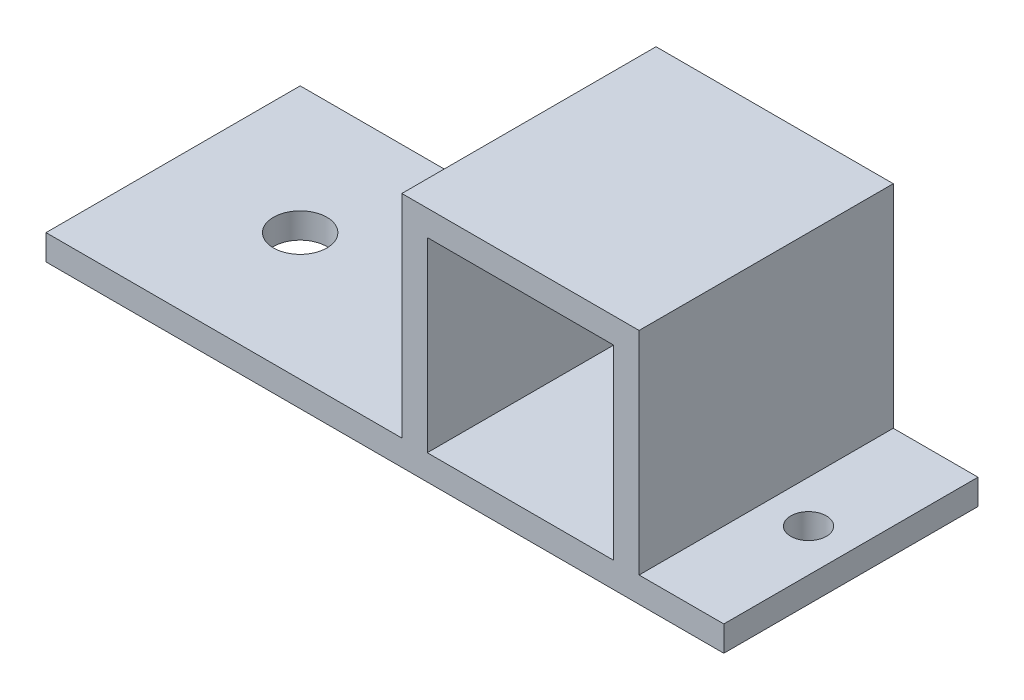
ISO-10303-21;
HEADER;
FILE_DESCRIPTION(('STEP AP214'),'2;1');
FILE_NAME('part.step','',(''),(''),'','','');
FILE_SCHEMA(('AUTOMOTIVE_DESIGN { 1 0 10303 214 1 1 1 1 }'));
ENDSEC;
DATA;
#1=APPLICATION_CONTEXT('core data for automotive mechanical design processes');
#2=APPLICATION_PROTOCOL_DEFINITION('international standard','automotive_design',2000,#1);
#3=PRODUCT_CONTEXT('',#1,'mechanical');
#4=PRODUCT('Part','Part','',(#3));
#5=PRODUCT_RELATED_PRODUCT_CATEGORY('part','',(#4));
#6=PRODUCT_DEFINITION_FORMATION('','',#4);
#7=PRODUCT_DEFINITION_CONTEXT('part definition',#1,'design');
#8=PRODUCT_DEFINITION('design','',#6,#7);
#9=PRODUCT_DEFINITION_SHAPE('','',#8);
#10=(LENGTH_UNIT() NAMED_UNIT(*) SI_UNIT(.MILLI.,.METRE.));
#11=(NAMED_UNIT(*) PLANE_ANGLE_UNIT() SI_UNIT($,.RADIAN.));
#12=(NAMED_UNIT(*) SI_UNIT($,.STERADIAN.) SOLID_ANGLE_UNIT());
#13=UNCERTAINTY_MEASURE_WITH_UNIT(LENGTH_MEASURE(1.E-05),#10,'distance_accuracy_value','');
#14=(GEOMETRIC_REPRESENTATION_CONTEXT(3) GLOBAL_UNCERTAINTY_ASSIGNED_CONTEXT((#13)) GLOBAL_UNIT_ASSIGNED_CONTEXT((#10,
#11,#12)) REPRESENTATION_CONTEXT('',''));
#15=CARTESIAN_POINT('',(0.,0.,0.));
#16=DIRECTION('',(0.,0.,1.));
#17=DIRECTION('',(1.,0.,0.));
#18=AXIS2_PLACEMENT_3D('',#15,#16,#17);
#19=CARTESIAN_POINT('',(-40.,1.5,15.));
#20=DIRECTION('',(0.,-1.,0.));
#21=DIRECTION('',(0.,0.,-1.));
#22=AXIS2_PLACEMENT_3D('',#19,#20,#21);
#23=PLANE('',#22);
#24=CARTESIAN_POINT('',(35.,1.5,0.));
#25=DIRECTION('',(0.,1.,0.));
#26=DIRECTION('',(0.,0.,1.));
#27=AXIS2_PLACEMENT_3D('',#24,#25,#26);
#28=CIRCLE('',#27,2.1);
#29=CARTESIAN_POINT('',(35.,1.5,2.1));
#30=VERTEX_POINT('',#29);
#31=EDGE_CURVE('E157',#30,#30,#28,.T.);
#32=ORIENTED_EDGE('',*,*,#31,.F.);
#33=EDGE_LOOP('',(#32));
#34=FACE_BOUND('',#33,.T.);
#35=DIRECTION('',(0.,0.,-1.));
#36=VECTOR('',#35,1.);
#37=CARTESIAN_POINT('',(30.,1.5,-15.));
#38=LINE('',#37,#36);
#39=CARTESIAN_POINT('',(30.,1.5,15.));
#40=VERTEX_POINT('',#39);
#41=CARTESIAN_POINT('',(30.,1.5,-15.));
#42=VERTEX_POINT('',#41);
#43=EDGE_CURVE('E176',#40,#42,#38,.T.);
#44=ORIENTED_EDGE('',*,*,#43,.F.);
#45=DIRECTION('',(-1.,0.,0.));
#46=VECTOR('',#45,1.);
#47=CARTESIAN_POINT('',(-40.,1.5,15.));
#48=LINE('',#47,#46);
#49=CARTESIAN_POINT('',(40.,1.5,15.));
#50=VERTEX_POINT('',#49);
#51=EDGE_CURVE('E225',#50,#40,#48,.T.);
#52=ORIENTED_EDGE('',*,*,#51,.F.);
#53=DIRECTION('',(0.,0.,-1.));
#54=VECTOR('',#53,1.);
#55=CARTESIAN_POINT('',(40.,1.5,15.));
#56=LINE('',#55,#54);
#57=CARTESIAN_POINT('',(40.,1.5,-15.));
#58=VERTEX_POINT('',#57);
#59=EDGE_CURVE('E11',#50,#58,#56,.T.);
#60=ORIENTED_EDGE('',*,*,#59,.T.);
#61=DIRECTION('',(-1.,0.,0.));
#62=VECTOR('',#61,1.);
#63=CARTESIAN_POINT('',(-40.,1.5,-15.));
#64=LINE('',#63,#62);
#65=EDGE_CURVE('E240',#58,#42,#64,.T.);
#66=ORIENTED_EDGE('',*,*,#65,.T.);
#67=EDGE_LOOP('',(#44,#52,#60,#66));
#68=FACE_BOUND('',#67,.T.);
#69=ADVANCED_FACE('F39',(#34,#68),#23,.F.);
#70=CARTESIAN_POINT('',(-25.,1.5,0.));
#71=DIRECTION('',(0.,1.,0.));
#72=DIRECTION('',(0.,0.,1.));
#73=AXIS2_PLACEMENT_3D('',#70,#71,#72);
#74=CIRCLE('',#73,3.15);
#75=CARTESIAN_POINT('',(-25.,1.5,3.15));
#76=VERTEX_POINT('',#75);
#77=EDGE_CURVE('E342',#76,#76,#74,.T.);
#78=ORIENTED_EDGE('',*,*,#77,.F.);
#79=EDGE_LOOP('',(#78));
#80=FACE_BOUND('',#79,.T.);
#81=DIRECTION('',(0.,0.,1.));
#82=VECTOR('',#81,1.);
#83=CARTESIAN_POINT('',(1.99999999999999,1.5,-15.));
#84=LINE('',#83,#82);
#85=CARTESIAN_POINT('',(1.99999999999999,1.5,-15.));
#86=VERTEX_POINT('',#85);
#87=CARTESIAN_POINT('',(1.99999999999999,1.5,15.));
#88=VERTEX_POINT('',#87);
#89=EDGE_CURVE('E187',#86,#88,#84,.T.);
#90=ORIENTED_EDGE('',*,*,#89,.F.);
#91=CARTESIAN_POINT('',(-40.,1.5,-15.));
#92=VERTEX_POINT('',#91);
#93=EDGE_CURVE('E239',#86,#92,#64,.T.);
#94=ORIENTED_EDGE('',*,*,#93,.T.);
#95=DIRECTION('',(0.,0.,-1.));
#96=VECTOR('',#95,1.);
#97=CARTESIAN_POINT('',(-40.,1.5,15.));
#98=LINE('',#97,#96);
#99=CARTESIAN_POINT('',(-40.,1.5,15.));
#100=VERTEX_POINT('',#99);
#101=EDGE_CURVE('E48',#100,#92,#98,.T.);
#102=ORIENTED_EDGE('',*,*,#101,.F.);
#103=EDGE_CURVE('E223',#88,#100,#48,.T.);
#104=ORIENTED_EDGE('',*,*,#103,.F.);
#105=EDGE_LOOP('',(#90,#94,#102,#104));
#106=FACE_BOUND('',#105,.T.);
#107=ADVANCED_FACE('F281',(#80,#106),#23,.F.);
#108=CARTESIAN_POINT('',(40.,1.5,15.));
#109=DIRECTION('',(-1.,0.,0.));
#110=DIRECTION('',(0.,0.,1.));
#111=AXIS2_PLACEMENT_3D('',#108,#109,#110);
#112=PLANE('',#111);
#113=DIRECTION('',(0.,1.,0.));
#114=VECTOR('',#113,1.);
#115=CARTESIAN_POINT('',(40.,1.5,-15.));
#116=LINE('',#115,#114);
#117=CARTESIAN_POINT('',(40.,-1.5,-15.));
#118=VERTEX_POINT('',#117);
#119=EDGE_CURVE('E218',#118,#58,#116,.T.);
#120=ORIENTED_EDGE('',*,*,#119,.T.);
#121=ORIENTED_EDGE('',*,*,#59,.F.);
#122=DIRECTION('',(0.,1.,0.));
#123=VECTOR('',#122,1.);
#124=CARTESIAN_POINT('',(40.,1.5,15.));
#125=LINE('',#124,#123);
#126=CARTESIAN_POINT('',(40.,-1.5,15.));
#127=VERTEX_POINT('',#126);
#128=EDGE_CURVE('E219',#127,#50,#125,.T.);
#129=ORIENTED_EDGE('',*,*,#128,.F.);
#130=DIRECTION('',(0.,0.,-1.));
#131=VECTOR('',#130,1.);
#132=CARTESIAN_POINT('',(40.,-1.5,15.));
#133=LINE('',#132,#131);
#134=EDGE_CURVE('E235',#127,#118,#133,.T.);
#135=ORIENTED_EDGE('',*,*,#134,.T.);
#136=EDGE_LOOP('',(#120,#121,#129,#135));
#137=FACE_BOUND('',#136,.T.);
#138=ADVANCED_FACE('F41',(#137),#112,.F.);
#139=CARTESIAN_POINT('',(-40.,1.5,15.));
#140=DIRECTION('',(1.,0.,0.));
#141=DIRECTION('',(0.,0.,-1.));
#142=AXIS2_PLACEMENT_3D('',#139,#140,#141);
#143=PLANE('',#142);
#144=DIRECTION('',(0.,-1.,0.));
#145=VECTOR('',#144,1.);
#146=CARTESIAN_POINT('',(-40.,1.5,-15.));
#147=LINE('',#146,#145);
#148=CARTESIAN_POINT('',(-40.,-1.5,-15.));
#149=VERTEX_POINT('',#148);
#150=EDGE_CURVE('E243',#92,#149,#147,.T.);
#151=ORIENTED_EDGE('',*,*,#150,.T.);
#152=DIRECTION('',(0.,0.,-1.));
#153=VECTOR('',#152,1.);
#154=CARTESIAN_POINT('',(-40.,-1.5,15.));
#155=LINE('',#154,#153);
#156=CARTESIAN_POINT('',(-40.,-1.5,15.));
#157=VERTEX_POINT('',#156);
#158=EDGE_CURVE('E251',#157,#149,#155,.T.);
#159=ORIENTED_EDGE('',*,*,#158,.F.);
#160=DIRECTION('',(0.,-1.,0.));
#161=VECTOR('',#160,1.);
#162=CARTESIAN_POINT('',(-40.,1.5,15.));
#163=LINE('',#162,#161);
#164=EDGE_CURVE('E229',#100,#157,#163,.T.);
#165=ORIENTED_EDGE('',*,*,#164,.F.);
#166=ORIENTED_EDGE('',*,*,#101,.T.);
#167=EDGE_LOOP('',(#151,#159,#165,#166));
#168=FACE_BOUND('',#167,.T.);
#169=ADVANCED_FACE('F260',(#168),#143,.F.);
#170=CARTESIAN_POINT('',(-40.,-1.5,15.));
#171=DIRECTION('',(0.,1.,0.));
#172=DIRECTION('',(0.,0.,1.));
#173=AXIS2_PLACEMENT_3D('',#170,#171,#172);
#174=PLANE('',#173);
#175=CARTESIAN_POINT('',(-25.,-1.5,0.));
#176=DIRECTION('',(0.,1.,0.));
#177=DIRECTION('',(0.,0.,1.));
#178=AXIS2_PLACEMENT_3D('',#175,#176,#177);
#179=CIRCLE('',#178,3.15);
#180=CARTESIAN_POINT('',(-25.,-1.5,3.15));
#181=VERTEX_POINT('',#180);
#182=EDGE_CURVE('E339',#181,#181,#179,.T.);
#183=ORIENTED_EDGE('',*,*,#182,.T.);
#184=EDGE_LOOP('',(#183));
#185=FACE_BOUND('',#184,.T.);
#186=CARTESIAN_POINT('',(35.,-1.5,0.));
#187=DIRECTION('',(0.,1.,0.));
#188=DIRECTION('',(0.,0.,1.));
#189=AXIS2_PLACEMENT_3D('',#186,#187,#188);
#190=CIRCLE('',#189,2.1);
#191=CARTESIAN_POINT('',(35.,-1.5,2.1));
#192=VERTEX_POINT('',#191);
#193=EDGE_CURVE('E167',#192,#192,#190,.T.);
#194=ORIENTED_EDGE('',*,*,#193,.T.);
#195=EDGE_LOOP('',(#194));
#196=FACE_BOUND('',#195,.T.);
#197=DIRECTION('',(1.,0.,0.));
#198=VECTOR('',#197,1.);
#199=CARTESIAN_POINT('',(-40.,-1.5,-15.));
#200=LINE('',#199,#198);
#201=EDGE_CURVE('E224',#149,#118,#200,.T.);
#202=ORIENTED_EDGE('',*,*,#201,.T.);
#203=ORIENTED_EDGE('',*,*,#134,.F.);
#204=DIRECTION('',(1.,0.,0.));
#205=VECTOR('',#204,1.);
#206=CARTESIAN_POINT('',(-40.,-1.5,15.));
#207=LINE('',#206,#205);
#208=EDGE_CURVE('E232',#157,#127,#207,.T.);
#209=ORIENTED_EDGE('',*,*,#208,.F.);
#210=ORIENTED_EDGE('',*,*,#158,.T.);
#211=EDGE_LOOP('',(#202,#203,#209,#210));
#212=FACE_BOUND('',#211,.T.);
#213=ADVANCED_FACE('F269',(#185,#196,#212),#174,.F.);
#214=CARTESIAN_POINT('',(0.,0.,15.));
#215=DIRECTION('',(0.,0.,1.));
#216=DIRECTION('',(1.,0.,0.));
#217=AXIS2_PLACEMENT_3D('',#214,#215,#216);
#218=PLANE('',#217);
#219=DIRECTION('',(0.,-1.,0.));
#220=VECTOR('',#219,1.);
#221=CARTESIAN_POINT('',(4.99999999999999,23.5,15.));
#222=LINE('',#221,#220);
#223=CARTESIAN_POINT('',(4.99999999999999,23.5,15.));
#224=VERTEX_POINT('',#223);
#225=CARTESIAN_POINT('',(5.,1.5,15.));
#226=VERTEX_POINT('',#225);
#227=EDGE_CURVE('E55',#224,#226,#222,.T.);
#228=ORIENTED_EDGE('',*,*,#227,.F.);
#229=DIRECTION('',(-1.,0.,0.));
#230=VECTOR('',#229,1.);
#231=CARTESIAN_POINT('',(4.99999999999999,23.5,15.));
#232=LINE('',#231,#230);
#233=CARTESIAN_POINT('',(27.,23.5,15.));
#234=VERTEX_POINT('',#233);
#235=EDGE_CURVE('E150',#234,#224,#232,.T.);
#236=ORIENTED_EDGE('',*,*,#235,.F.);
#237=DIRECTION('',(0.,1.,0.));
#238=VECTOR('',#237,1.);
#239=CARTESIAN_POINT('',(27.,23.5,15.));
#240=LINE('',#239,#238);
#241=CARTESIAN_POINT('',(27.,1.5,15.));
#242=VERTEX_POINT('',#241);
#243=EDGE_CURVE('E154',#242,#234,#240,.T.);
#244=ORIENTED_EDGE('',*,*,#243,.F.);
#245=DIRECTION('',(1.,0.,0.));
#246=VECTOR('',#245,1.);
#247=CARTESIAN_POINT('',(5.,1.5,15.));
#248=LINE('',#247,#246);
#249=EDGE_CURVE('E166',#226,#242,#248,.T.);
#250=ORIENTED_EDGE('',*,*,#249,.F.);
#251=EDGE_LOOP('',(#228,#236,#244,#250));
#252=FACE_BOUND('',#251,.T.);
#253=ORIENTED_EDGE('',*,*,#128,.T.);
#254=ORIENTED_EDGE('',*,*,#51,.T.);
#255=DIRECTION('',(0.,-1.,0.));
#256=VECTOR('',#255,1.);
#257=CARTESIAN_POINT('',(30.,26.5,15.));
#258=LINE('',#257,#256);
#259=CARTESIAN_POINT('',(30.,26.5,15.));
#260=VERTEX_POINT('',#259);
#261=EDGE_CURVE('E196',#260,#40,#258,.T.);
#262=ORIENTED_EDGE('',*,*,#261,.F.);
#263=DIRECTION('',(1.,0.,0.));
#264=VECTOR('',#263,1.);
#265=CARTESIAN_POINT('',(1.99999999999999,26.5,15.));
#266=LINE('',#265,#264);
#267=CARTESIAN_POINT('',(1.99999999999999,26.5,15.));
#268=VERTEX_POINT('',#267);
#269=EDGE_CURVE('E193',#268,#260,#266,.T.);
#270=ORIENTED_EDGE('',*,*,#269,.F.);
#271=DIRECTION('',(0.,-1.,0.));
#272=VECTOR('',#271,1.);
#273=CARTESIAN_POINT('',(1.99999999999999,26.5,15.));
#274=LINE('',#273,#272);
#275=EDGE_CURVE('E206',#268,#88,#274,.T.);
#276=ORIENTED_EDGE('',*,*,#275,.T.);
#277=ORIENTED_EDGE('',*,*,#103,.T.);
#278=ORIENTED_EDGE('',*,*,#164,.T.);
#279=ORIENTED_EDGE('',*,*,#208,.T.);
#280=EDGE_LOOP('',(#253,#254,#262,#270,#276,#277,#278,#279));
#281=FACE_BOUND('',#280,.T.);
#282=ADVANCED_FACE('F275',(#252,#281),#218,.T.);
#283=CARTESIAN_POINT('',(0.,0.,-15.));
#284=DIRECTION('',(0.,0.,1.));
#285=DIRECTION('',(1.,0.,0.));
#286=AXIS2_PLACEMENT_3D('',#283,#284,#285);
#287=PLANE('',#286);
#288=DIRECTION('',(-1.,0.,0.));
#289=VECTOR('',#288,1.);
#290=CARTESIAN_POINT('',(4.99999999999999,23.5,-15.));
#291=LINE('',#290,#289);
#292=CARTESIAN_POINT('',(27.,23.5,-15.));
#293=VERTEX_POINT('',#292);
#294=CARTESIAN_POINT('',(4.99999999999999,23.5,-15.));
#295=VERTEX_POINT('',#294);
#296=EDGE_CURVE('E138',#293,#295,#291,.T.);
#297=ORIENTED_EDGE('',*,*,#296,.T.);
#298=DIRECTION('',(0.,-1.,0.));
#299=VECTOR('',#298,1.);
#300=CARTESIAN_POINT('',(4.99999999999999,23.5,-15.));
#301=LINE('',#300,#299);
#302=CARTESIAN_POINT('',(5.,1.5,-15.));
#303=VERTEX_POINT('',#302);
#304=EDGE_CURVE('E131',#295,#303,#301,.T.);
#305=ORIENTED_EDGE('',*,*,#304,.T.);
#306=DIRECTION('',(1.,0.,0.));
#307=VECTOR('',#306,1.);
#308=CARTESIAN_POINT('',(5.,1.5,-15.));
#309=LINE('',#308,#307);
#310=CARTESIAN_POINT('',(27.,1.5,-15.));
#311=VERTEX_POINT('',#310);
#312=EDGE_CURVE('E141',#303,#311,#309,.T.);
#313=ORIENTED_EDGE('',*,*,#312,.T.);
#314=DIRECTION('',(0.,1.,0.));
#315=VECTOR('',#314,1.);
#316=CARTESIAN_POINT('',(27.,23.5,-15.));
#317=LINE('',#316,#315);
#318=EDGE_CURVE('E63',#311,#293,#317,.T.);
#319=ORIENTED_EDGE('',*,*,#318,.T.);
#320=EDGE_LOOP('',(#297,#305,#313,#319));
#321=FACE_BOUND('',#320,.T.);
#322=ORIENTED_EDGE('',*,*,#119,.F.);
#323=ORIENTED_EDGE('',*,*,#201,.F.);
#324=ORIENTED_EDGE('',*,*,#150,.F.);
#325=ORIENTED_EDGE('',*,*,#93,.F.);
#326=DIRECTION('',(0.,-1.,0.));
#327=VECTOR('',#326,1.);
#328=CARTESIAN_POINT('',(1.99999999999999,26.5,-15.));
#329=LINE('',#328,#327);
#330=CARTESIAN_POINT('',(1.99999999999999,26.5,-15.));
#331=VERTEX_POINT('',#330);
#332=EDGE_CURVE('E210',#331,#86,#329,.T.);
#333=ORIENTED_EDGE('',*,*,#332,.F.);
#334=DIRECTION('',(-1.,0.,0.));
#335=VECTOR('',#334,1.);
#336=CARTESIAN_POINT('',(1.99999999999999,26.5,-15.));
#337=LINE('',#336,#335);
#338=CARTESIAN_POINT('',(30.,26.5,-15.));
#339=VERTEX_POINT('',#338);
#340=EDGE_CURVE('E186',#339,#331,#337,.T.);
#341=ORIENTED_EDGE('',*,*,#340,.F.);
#342=DIRECTION('',(0.,-1.,0.));
#343=VECTOR('',#342,1.);
#344=CARTESIAN_POINT('',(30.,26.5,-15.));
#345=LINE('',#344,#343);
#346=EDGE_CURVE('E214',#339,#42,#345,.T.);
#347=ORIENTED_EDGE('',*,*,#346,.T.);
#348=ORIENTED_EDGE('',*,*,#65,.F.);
#349=EDGE_LOOP('',(#322,#323,#324,#325,#333,#341,#347,#348));
#350=FACE_BOUND('',#349,.T.);
#351=ADVANCED_FACE('F146',(#321,#350),#287,.F.);
#352=CARTESIAN_POINT('',(30.,26.5,-15.));
#353=DIRECTION('',(-1.,0.,0.));
#354=DIRECTION('',(0.,0.,1.));
#355=AXIS2_PLACEMENT_3D('',#352,#353,#354);
#356=PLANE('',#355);
#357=ORIENTED_EDGE('',*,*,#43,.T.);
#358=ORIENTED_EDGE('',*,*,#346,.F.);
#359=DIRECTION('',(0.,0.,-1.));
#360=VECTOR('',#359,1.);
#361=CARTESIAN_POINT('',(30.,26.5,-15.));
#362=LINE('',#361,#360);
#363=EDGE_CURVE('E182',#260,#339,#362,.T.);
#364=ORIENTED_EDGE('',*,*,#363,.F.);
#365=ORIENTED_EDGE('',*,*,#261,.T.);
#366=EDGE_LOOP('',(#357,#358,#364,#365));
#367=FACE_BOUND('',#366,.T.);
#368=ADVANCED_FACE('F290',(#367),#356,.F.);
#369=CARTESIAN_POINT('',(1.99999999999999,26.5,-15.));
#370=DIRECTION('',(1.,0.,0.));
#371=DIRECTION('',(0.,0.,-1.));
#372=AXIS2_PLACEMENT_3D('',#369,#370,#371);
#373=PLANE('',#372);
#374=ORIENTED_EDGE('',*,*,#89,.T.);
#375=ORIENTED_EDGE('',*,*,#275,.F.);
#376=DIRECTION('',(0.,0.,1.));
#377=VECTOR('',#376,1.);
#378=CARTESIAN_POINT('',(1.99999999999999,26.5,-15.));
#379=LINE('',#378,#377);
#380=EDGE_CURVE('E190',#331,#268,#379,.T.);
#381=ORIENTED_EDGE('',*,*,#380,.F.);
#382=ORIENTED_EDGE('',*,*,#332,.T.);
#383=EDGE_LOOP('',(#374,#375,#381,#382));
#384=FACE_BOUND('',#383,.T.);
#385=ADVANCED_FACE('F283',(#384),#373,.F.);
#386=CARTESIAN_POINT('',(0.,26.5,0.));
#387=DIRECTION('',(0.,1.,0.));
#388=DIRECTION('',(0.,0.,1.));
#389=AXIS2_PLACEMENT_3D('',#386,#387,#388);
#390=PLANE('',#389);
#391=ORIENTED_EDGE('',*,*,#363,.T.);
#392=ORIENTED_EDGE('',*,*,#340,.T.);
#393=ORIENTED_EDGE('',*,*,#380,.T.);
#394=ORIENTED_EDGE('',*,*,#269,.T.);
#395=EDGE_LOOP('',(#391,#392,#393,#394));
#396=FACE_BOUND('',#395,.T.);
#397=ADVANCED_FACE('F288',(#396),#390,.T.);
#398=CARTESIAN_POINT('',(4.99999999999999,23.5,-15.));
#399=DIRECTION('',(-1.,0.,0.));
#400=DIRECTION('',(0.,-1.,0.));
#401=AXIS2_PLACEMENT_3D('',#398,#399,#400);
#402=PLANE('',#401);
#403=ORIENTED_EDGE('',*,*,#227,.T.);
#404=DIRECTION('',(0.,0.,1.));
#405=VECTOR('',#404,1.);
#406=CARTESIAN_POINT('',(5.,1.5,-15.));
#407=LINE('',#406,#405);
#408=EDGE_CURVE('E127',#303,#226,#407,.T.);
#409=ORIENTED_EDGE('',*,*,#408,.F.);
#410=ORIENTED_EDGE('',*,*,#304,.F.);
#411=DIRECTION('',(0.,0.,1.));
#412=VECTOR('',#411,1.);
#413=CARTESIAN_POINT('',(4.99999999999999,23.5,-15.));
#414=LINE('',#413,#412);
#415=EDGE_CURVE('E173',#295,#224,#414,.T.);
#416=ORIENTED_EDGE('',*,*,#415,.T.);
#417=EDGE_LOOP('',(#403,#409,#410,#416));
#418=FACE_BOUND('',#417,.T.);
#419=ADVANCED_FACE('F129',(#418),#402,.F.);
#420=CARTESIAN_POINT('',(4.99999999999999,23.5,-15.));
#421=DIRECTION('',(0.,1.,0.));
#422=DIRECTION('',(0.,0.,1.));
#423=AXIS2_PLACEMENT_3D('',#420,#421,#422);
#424=PLANE('',#423);
#425=ORIENTED_EDGE('',*,*,#235,.T.);
#426=ORIENTED_EDGE('',*,*,#415,.F.);
#427=ORIENTED_EDGE('',*,*,#296,.F.);
#428=DIRECTION('',(0.,0.,1.));
#429=VECTOR('',#428,1.);
#430=CARTESIAN_POINT('',(27.,23.5,-15.));
#431=LINE('',#430,#429);
#432=EDGE_CURVE('E177',#293,#234,#431,.T.);
#433=ORIENTED_EDGE('',*,*,#432,.T.);
#434=EDGE_LOOP('',(#425,#426,#427,#433));
#435=FACE_BOUND('',#434,.T.);
#436=ADVANCED_FACE('F318',(#435),#424,.F.);
#437=CARTESIAN_POINT('',(27.,23.5,-15.));
#438=DIRECTION('',(1.,0.,0.));
#439=DIRECTION('',(0.,1.,0.));
#440=AXIS2_PLACEMENT_3D('',#437,#438,#439);
#441=PLANE('',#440);
#442=ORIENTED_EDGE('',*,*,#243,.T.);
#443=ORIENTED_EDGE('',*,*,#432,.F.);
#444=ORIENTED_EDGE('',*,*,#318,.F.);
#445=DIRECTION('',(0.,0.,1.));
#446=VECTOR('',#445,1.);
#447=CARTESIAN_POINT('',(27.,1.5,-15.));
#448=LINE('',#447,#446);
#449=EDGE_CURVE('E137',#311,#242,#448,.T.);
#450=ORIENTED_EDGE('',*,*,#449,.T.);
#451=EDGE_LOOP('',(#442,#443,#444,#450));
#452=FACE_BOUND('',#451,.T.);
#453=ADVANCED_FACE('F322',(#452),#441,.F.);
#454=CARTESIAN_POINT('',(5.,1.5,-15.));
#455=DIRECTION('',(0.,-1.,0.));
#456=DIRECTION('',(1.,0.,0.));
#457=AXIS2_PLACEMENT_3D('',#454,#455,#456);
#458=PLANE('',#457);
#459=ORIENTED_EDGE('',*,*,#249,.T.);
#460=ORIENTED_EDGE('',*,*,#449,.F.);
#461=ORIENTED_EDGE('',*,*,#312,.F.);
#462=ORIENTED_EDGE('',*,*,#408,.T.);
#463=EDGE_LOOP('',(#459,#460,#461,#462));
#464=FACE_BOUND('',#463,.T.);
#465=ADVANCED_FACE('F142',(#464),#458,.F.);
#466=CARTESIAN_POINT('',(35.,-1.5,0.));
#467=DIRECTION('',(0.,1.,0.));
#468=DIRECTION('',(0.,0.,1.));
#469=AXIS2_PLACEMENT_3D('',#466,#467,#468);
#470=CYLINDRICAL_SURFACE('',#469,2.1);
#471=ORIENTED_EDGE('',*,*,#193,.F.);
#472=EDGE_LOOP('',(#471));
#473=FACE_BOUND('',#472,.T.);
#474=ORIENTED_EDGE('',*,*,#31,.T.);
#475=EDGE_LOOP('',(#474));
#476=FACE_BOUND('',#475,.T.);
#477=ADVANCED_FACE('F321',(#473,#476),#470,.F.);
#478=CARTESIAN_POINT('',(-25.,-1.5,0.));
#479=DIRECTION('',(0.,1.,0.));
#480=DIRECTION('',(0.,0.,1.));
#481=AXIS2_PLACEMENT_3D('',#478,#479,#480);
#482=CYLINDRICAL_SURFACE('',#481,3.15);
#483=ORIENTED_EDGE('',*,*,#182,.F.);
#484=EDGE_LOOP('',(#483));
#485=FACE_BOUND('',#484,.T.);
#486=ORIENTED_EDGE('',*,*,#77,.T.);
#487=EDGE_LOOP('',(#486));
#488=FACE_BOUND('',#487,.T.);
#489=ADVANCED_FACE('F330',(#485,#488),#482,.F.);
#490=CLOSED_SHELL('',(#69,#107,#138,#169,#213,#282,#351,#368,#385,#397,#419,#436,#453,#465,#477,#489));
#491=MANIFOLD_SOLID_BREP('B2',#490);
#492=ADVANCED_BREP_SHAPE_REPRESENTATION('',(#18,#491),#14);
#493=SHAPE_DEFINITION_REPRESENTATION(#9,#492);
ENDSEC;
END-ISO-10303-21;
